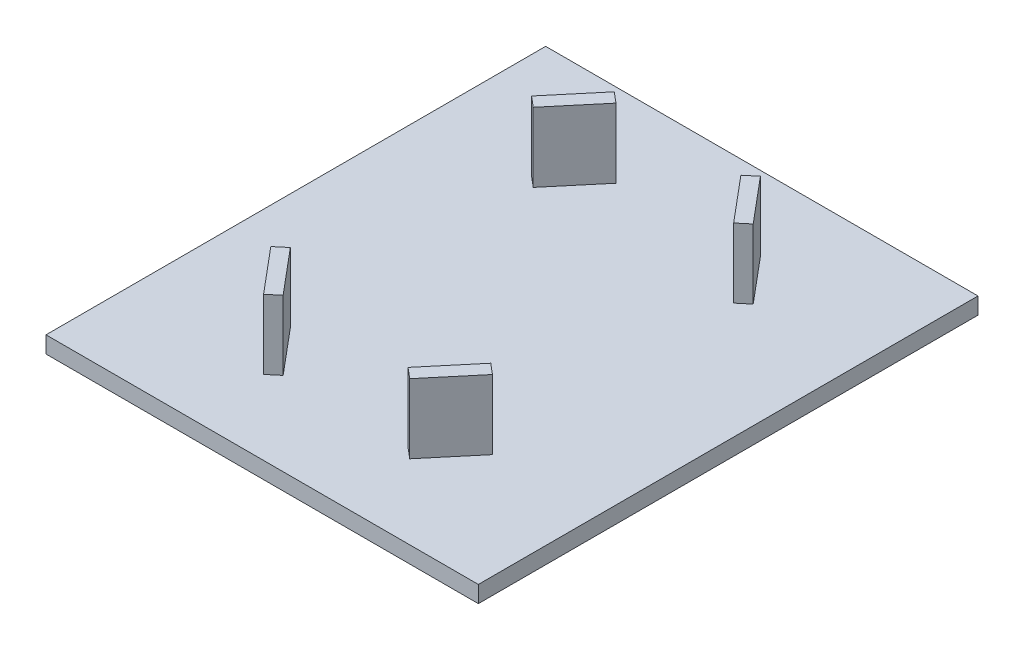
ISO-10303-21;
HEADER;
FILE_DESCRIPTION(('STEP AP214'),'2;1');
FILE_NAME('part.step','',(''),(''),'','','');
FILE_SCHEMA(('AUTOMOTIVE_DESIGN { 1 0 10303 214 1 1 1 1 }'));
ENDSEC;
DATA;
#1=APPLICATION_CONTEXT('core data for automotive mechanical design processes');
#2=APPLICATION_PROTOCOL_DEFINITION('international standard','automotive_design',2000,#1);
#3=PRODUCT_CONTEXT('',#1,'mechanical');
#4=PRODUCT('Part','Part','',(#3));
#5=PRODUCT_RELATED_PRODUCT_CATEGORY('part','',(#4));
#6=PRODUCT_DEFINITION_FORMATION('','',#4);
#7=PRODUCT_DEFINITION_CONTEXT('part definition',#1,'design');
#8=PRODUCT_DEFINITION('design','',#6,#7);
#9=PRODUCT_DEFINITION_SHAPE('','',#8);
#10=(LENGTH_UNIT() NAMED_UNIT(*) SI_UNIT(.MILLI.,.METRE.));
#11=(NAMED_UNIT(*) PLANE_ANGLE_UNIT() SI_UNIT($,.RADIAN.));
#12=(NAMED_UNIT(*) SI_UNIT($,.STERADIAN.) SOLID_ANGLE_UNIT());
#13=UNCERTAINTY_MEASURE_WITH_UNIT(LENGTH_MEASURE(1.E-05),#10,'distance_accuracy_value','');
#14=(GEOMETRIC_REPRESENTATION_CONTEXT(3) GLOBAL_UNCERTAINTY_ASSIGNED_CONTEXT((#13)) GLOBAL_UNIT_ASSIGNED_CONTEXT((#10,
#11,#12)) REPRESENTATION_CONTEXT('',''));
#15=CARTESIAN_POINT('',(0.,0.,0.));
#16=DIRECTION('',(0.,0.,1.));
#17=DIRECTION('',(1.,0.,0.));
#18=AXIS2_PLACEMENT_3D('',#15,#16,#17);
#19=CARTESIAN_POINT('',(-115.75,12.,-180.));
#20=DIRECTION('',(0.,0.,1.));
#21=DIRECTION('',(1.,0.,0.));
#22=AXIS2_PLACEMENT_3D('',#19,#20,#21);
#23=PLANE('',#22);
#24=DIRECTION('',(-1.,0.,0.));
#25=VECTOR('',#24,1.);
#26=CARTESIAN_POINT('',(-115.75,0.,-180.));
#27=LINE('',#26,#25);
#28=CARTESIAN_POINT('',(155.75,0.,-180.));
#29=VERTEX_POINT('',#28);
#30=CARTESIAN_POINT('',(-155.75,0.,-180.));
#31=VERTEX_POINT('',#30);
#32=EDGE_CURVE('E344',#29,#31,#27,.T.);
#33=ORIENTED_EDGE('',*,*,#32,.T.);
#34=DIRECTION('',(0.,-1.,0.));
#35=VECTOR('',#34,1.);
#36=CARTESIAN_POINT('',(-155.75,12.,-180.));
#37=LINE('',#36,#35);
#38=CARTESIAN_POINT('',(-155.75,12.,-180.));
#39=VERTEX_POINT('',#38);
#40=EDGE_CURVE('E53',#39,#31,#37,.T.);
#41=ORIENTED_EDGE('',*,*,#40,.F.);
#42=DIRECTION('',(-1.,0.,0.));
#43=VECTOR('',#42,1.);
#44=CARTESIAN_POINT('',(115.75,12.,-180.));
#45=LINE('',#44,#43);
#46=CARTESIAN_POINT('',(155.75,12.,-180.));
#47=VERTEX_POINT('',#46);
#48=EDGE_CURVE('E360',#47,#39,#45,.T.);
#49=ORIENTED_EDGE('',*,*,#48,.F.);
#50=DIRECTION('',(0.,-1.,0.));
#51=VECTOR('',#50,1.);
#52=CARTESIAN_POINT('',(155.75,12.,-180.));
#53=LINE('',#52,#51);
#54=EDGE_CURVE('E11',#47,#29,#53,.T.);
#55=ORIENTED_EDGE('',*,*,#54,.T.);
#56=EDGE_LOOP('',(#33,#41,#49,#55));
#57=FACE_BOUND('',#56,.T.);
#58=ADVANCED_FACE('F45',(#57),#23,.F.);
#59=CARTESIAN_POINT('',(-155.75,12.,140.));
#60=DIRECTION('',(1.,0.,0.));
#61=DIRECTION('',(0.,0.,-1.));
#62=AXIS2_PLACEMENT_3D('',#59,#60,#61);
#63=PLANE('',#62);
#64=DIRECTION('',(0.,0.,1.));
#65=VECTOR('',#64,1.);
#66=CARTESIAN_POINT('',(-155.75,0.,140.));
#67=LINE('',#66,#65);
#68=CARTESIAN_POINT('',(-155.75,0.,180.));
#69=VERTEX_POINT('',#68);
#70=EDGE_CURVE('E374',#31,#69,#67,.T.);
#71=ORIENTED_EDGE('',*,*,#70,.T.);
#72=DIRECTION('',(0.,-1.,0.));
#73=VECTOR('',#72,1.);
#74=CARTESIAN_POINT('',(-155.75,12.,180.));
#75=LINE('',#74,#73);
#76=CARTESIAN_POINT('',(-155.75,12.,180.));
#77=VERTEX_POINT('',#76);
#78=EDGE_CURVE('E388',#77,#69,#75,.T.);
#79=ORIENTED_EDGE('',*,*,#78,.F.);
#80=DIRECTION('',(0.,0.,1.));
#81=VECTOR('',#80,1.);
#82=CARTESIAN_POINT('',(-155.75,12.,-180.));
#83=LINE('',#82,#81);
#84=EDGE_CURVE('E364',#39,#77,#83,.T.);
#85=ORIENTED_EDGE('',*,*,#84,.F.);
#86=ORIENTED_EDGE('',*,*,#40,.T.);
#87=EDGE_LOOP('',(#71,#79,#85,#86));
#88=FACE_BOUND('',#87,.T.);
#89=ADVANCED_FACE('F396',(#88),#63,.F.);
#90=CARTESIAN_POINT('',(115.75,12.,180.));
#91=DIRECTION('',(0.,0.,-1.));
#92=DIRECTION('',(-1.,0.,0.));
#93=AXIS2_PLACEMENT_3D('',#90,#91,#92);
#94=PLANE('',#93);
#95=DIRECTION('',(1.,0.,0.));
#96=VECTOR('',#95,1.);
#97=CARTESIAN_POINT('',(115.75,0.,180.));
#98=LINE('',#97,#96);
#99=CARTESIAN_POINT('',(155.75,0.,180.));
#100=VERTEX_POINT('',#99);
#101=EDGE_CURVE('E378',#69,#100,#98,.T.);
#102=ORIENTED_EDGE('',*,*,#101,.T.);
#103=DIRECTION('',(0.,-1.,0.));
#104=VECTOR('',#103,1.);
#105=CARTESIAN_POINT('',(155.75,12.,180.));
#106=LINE('',#105,#104);
#107=CARTESIAN_POINT('',(155.75,12.,180.));
#108=VERTEX_POINT('',#107);
#109=EDGE_CURVE('E370',#108,#100,#106,.T.);
#110=ORIENTED_EDGE('',*,*,#109,.F.);
#111=DIRECTION('',(1.,0.,0.));
#112=VECTOR('',#111,1.);
#113=CARTESIAN_POINT('',(-155.75,12.,180.));
#114=LINE('',#113,#112);
#115=EDGE_CURVE('E367',#77,#108,#114,.T.);
#116=ORIENTED_EDGE('',*,*,#115,.F.);
#117=ORIENTED_EDGE('',*,*,#78,.T.);
#118=EDGE_LOOP('',(#102,#110,#116,#117));
#119=FACE_BOUND('',#118,.T.);
#120=ADVANCED_FACE('F408',(#119),#94,.F.);
#121=CARTESIAN_POINT('',(155.75,12.,140.));
#122=DIRECTION('',(-1.,0.,0.));
#123=DIRECTION('',(0.,0.,1.));
#124=AXIS2_PLACEMENT_3D('',#121,#122,#123);
#125=PLANE('',#124);
#126=DIRECTION('',(0.,0.,-1.));
#127=VECTOR('',#126,1.);
#128=CARTESIAN_POINT('',(155.75,0.,140.));
#129=LINE('',#128,#127);
#130=EDGE_CURVE('E361',#100,#29,#129,.T.);
#131=ORIENTED_EDGE('',*,*,#130,.T.);
#132=ORIENTED_EDGE('',*,*,#54,.F.);
#133=DIRECTION('',(0.,0.,-1.));
#134=VECTOR('',#133,1.);
#135=CARTESIAN_POINT('',(155.75,12.,-180.));
#136=LINE('',#135,#134);
#137=EDGE_CURVE('E356',#108,#47,#136,.T.);
#138=ORIENTED_EDGE('',*,*,#137,.F.);
#139=ORIENTED_EDGE('',*,*,#109,.T.);
#140=EDGE_LOOP('',(#131,#132,#138,#139));
#141=FACE_BOUND('',#140,.T.);
#142=ADVANCED_FACE('F403',(#141),#125,.F.);
#143=CARTESIAN_POINT('',(0.,12.,0.));
#144=DIRECTION('',(0.,1.,0.));
#145=DIRECTION('',(0.,0.,1.));
#146=AXIS2_PLACEMENT_3D('',#143,#144,#145);
#147=PLANE('',#146);
#148=DIRECTION('',(0.642787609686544,0.,0.766044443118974));
#149=VECTOR('',#148,1.);
#150=CARTESIAN_POINT('',(-72.1899158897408,12.,87.5));
#151=LINE('',#150,#149);
#152=CARTESIAN_POINT('',(-72.1899158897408,12.,87.5));
#153=VERTEX_POINT('',#152);
#154=CARTESIAN_POINT('',(-45.,12.,119.903679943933));
#155=VERTEX_POINT('',#154);
#156=EDGE_CURVE('E250',#153,#155,#151,.T.);
#157=ORIENTED_EDGE('',*,*,#156,.T.);
#158=DIRECTION('',(0.76604444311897,0.,-0.642787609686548));
#159=VECTOR('',#158,1.);
#160=CARTESIAN_POINT('',(-52.6604444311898,12.,126.331556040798));
#161=LINE('',#160,#159);
#162=CARTESIAN_POINT('',(-52.6604444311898,12.,126.331556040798));
#163=VERTEX_POINT('',#162);
#164=EDGE_CURVE('E295',#163,#155,#161,.T.);
#165=ORIENTED_EDGE('',*,*,#164,.F.);
#166=DIRECTION('',(0.642787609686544,0.,0.766044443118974));
#167=VECTOR('',#166,1.);
#168=CARTESIAN_POINT('',(-79.8503603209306,12.,93.9278760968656));
#169=LINE('',#168,#167);
#170=CARTESIAN_POINT('',(-79.8503603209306,12.,93.9278760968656));
#171=VERTEX_POINT('',#170);
#172=EDGE_CURVE('E291',#171,#163,#169,.T.);
#173=ORIENTED_EDGE('',*,*,#172,.F.);
#174=DIRECTION('',(-0.766044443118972,0.,0.642787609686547));
#175=VECTOR('',#174,1.);
#176=CARTESIAN_POINT('',(-72.1899158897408,12.,87.5));
#177=LINE('',#176,#175);
#178=EDGE_CURVE('E288',#153,#171,#177,.T.);
#179=ORIENTED_EDGE('',*,*,#178,.F.);
#180=EDGE_LOOP('',(#157,#165,#173,#179));
#181=FACE_BOUND('',#180,.T.);
#182=DIRECTION('',(0.766044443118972,0.,0.642787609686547));
#183=VECTOR('',#182,1.);
#184=CARTESIAN_POINT('',(72.1899158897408,12.,87.5));
#185=LINE('',#184,#183);
#186=CARTESIAN_POINT('',(72.1899158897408,12.,87.5));
#187=VERTEX_POINT('',#186);
#188=CARTESIAN_POINT('',(79.8503603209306,12.,93.9278760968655));
#189=VERTEX_POINT('',#188);
#190=EDGE_CURVE('E196',#187,#189,#185,.T.);
#191=ORIENTED_EDGE('',*,*,#190,.T.);
#192=DIRECTION('',(-0.642787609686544,0.,0.766044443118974));
#193=VECTOR('',#192,1.);
#194=CARTESIAN_POINT('',(79.8503603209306,12.,93.9278760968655));
#195=LINE('',#194,#193);
#196=CARTESIAN_POINT('',(52.6604444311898,12.,126.331556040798));
#197=VERTEX_POINT('',#196);
#198=EDGE_CURVE('E257',#189,#197,#195,.T.);
#199=ORIENTED_EDGE('',*,*,#198,.T.);
#200=DIRECTION('',(-0.76604444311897,0.,-0.642787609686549));
#201=VECTOR('',#200,1.);
#202=CARTESIAN_POINT('',(52.6604444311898,12.,126.331556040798));
#203=LINE('',#202,#201);
#204=CARTESIAN_POINT('',(45.,12.,119.903679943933));
#205=VERTEX_POINT('',#204);
#206=EDGE_CURVE('E253',#197,#205,#203,.T.);
#207=ORIENTED_EDGE('',*,*,#206,.T.);
#208=DIRECTION('',(-0.642787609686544,0.,0.766044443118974));
#209=VECTOR('',#208,1.);
#210=CARTESIAN_POINT('',(72.1899158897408,12.,87.5));
#211=LINE('',#210,#209);
#212=EDGE_CURVE('E68',#187,#205,#211,.T.);
#213=ORIENTED_EDGE('',*,*,#212,.F.);
#214=EDGE_LOOP('',(#191,#199,#207,#213));
#215=FACE_BOUND('',#214,.T.);
#216=DIRECTION('',(-0.642787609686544,0.,-0.766044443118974));
#217=VECTOR('',#216,1.);
#218=CARTESIAN_POINT('',(72.1899158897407,12.,-87.5));
#219=LINE('',#218,#217);
#220=CARTESIAN_POINT('',(72.1899158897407,12.,-87.5));
#221=VERTEX_POINT('',#220);
#222=CARTESIAN_POINT('',(45.,12.,-119.903679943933));
#223=VERTEX_POINT('',#222);
#224=EDGE_CURVE('E199',#221,#223,#219,.T.);
#225=ORIENTED_EDGE('',*,*,#224,.T.);
#226=DIRECTION('',(-0.766044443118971,0.,0.642787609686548));
#227=VECTOR('',#226,1.);
#228=CARTESIAN_POINT('',(52.6604444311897,12.,-126.331556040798));
#229=LINE('',#228,#227);
#230=CARTESIAN_POINT('',(52.6604444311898,12.,-126.331556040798));
#231=VERTEX_POINT('',#230);
#232=EDGE_CURVE('E208',#231,#223,#229,.T.);
#233=ORIENTED_EDGE('',*,*,#232,.F.);
#234=DIRECTION('',(-0.642787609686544,0.,-0.766044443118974));
#235=VECTOR('',#234,1.);
#236=CARTESIAN_POINT('',(79.8503603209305,12.,-93.9278760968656));
#237=LINE('',#236,#235);
#238=CARTESIAN_POINT('',(79.8503603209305,12.,-93.9278760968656));
#239=VERTEX_POINT('',#238);
#240=EDGE_CURVE('E214',#239,#231,#237,.T.);
#241=ORIENTED_EDGE('',*,*,#240,.F.);
#242=DIRECTION('',(0.766044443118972,0.,-0.642787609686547));
#243=VECTOR('',#242,1.);
#244=CARTESIAN_POINT('',(72.1899158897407,12.,-87.5));
#245=LINE('',#244,#243);
#246=EDGE_CURVE('E188',#221,#239,#245,.T.);
#247=ORIENTED_EDGE('',*,*,#246,.F.);
#248=EDGE_LOOP('',(#225,#233,#241,#247));
#249=FACE_BOUND('',#248,.T.);
#250=DIRECTION('',(-0.766044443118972,0.,-0.642787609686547));
#251=VECTOR('',#250,1.);
#252=CARTESIAN_POINT('',(-72.1899158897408,12.,-87.5));
#253=LINE('',#252,#251);
#254=CARTESIAN_POINT('',(-72.1899158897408,12.,-87.5));
#255=VERTEX_POINT('',#254);
#256=CARTESIAN_POINT('',(-79.8503603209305,12.,-93.9278760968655));
#257=VERTEX_POINT('',#256);
#258=EDGE_CURVE('E207',#255,#257,#253,.T.);
#259=ORIENTED_EDGE('',*,*,#258,.T.);
#260=DIRECTION('',(0.642787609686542,0.,-0.766044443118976));
#261=VECTOR('',#260,1.);
#262=CARTESIAN_POINT('',(-79.8503603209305,12.,-93.9278760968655));
#263=LINE('',#262,#261);
#264=CARTESIAN_POINT('',(-52.6604444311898,12.,-126.331556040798));
#265=VERTEX_POINT('',#264);
#266=EDGE_CURVE('E331',#257,#265,#263,.T.);
#267=ORIENTED_EDGE('',*,*,#266,.T.);
#268=DIRECTION('',(0.76604444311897,0.,0.642787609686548));
#269=VECTOR('',#268,1.);
#270=CARTESIAN_POINT('',(-52.6604444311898,12.,-126.331556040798));
#271=LINE('',#270,#269);
#272=CARTESIAN_POINT('',(-45.,12.,-119.903679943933));
#273=VERTEX_POINT('',#272);
#274=EDGE_CURVE('E334',#265,#273,#271,.T.);
#275=ORIENTED_EDGE('',*,*,#274,.T.);
#276=DIRECTION('',(0.642787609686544,0.,-0.766044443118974));
#277=VECTOR('',#276,1.);
#278=CARTESIAN_POINT('',(-72.1899158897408,12.,-87.5));
#279=LINE('',#278,#277);
#280=EDGE_CURVE('E317',#255,#273,#279,.T.);
#281=ORIENTED_EDGE('',*,*,#280,.F.);
#282=EDGE_LOOP('',(#259,#267,#275,#281));
#283=FACE_BOUND('',#282,.T.);
#284=ORIENTED_EDGE('',*,*,#137,.T.);
#285=ORIENTED_EDGE('',*,*,#48,.T.);
#286=ORIENTED_EDGE('',*,*,#84,.T.);
#287=ORIENTED_EDGE('',*,*,#115,.T.);
#288=EDGE_LOOP('',(#284,#285,#286,#287));
#289=FACE_BOUND('',#288,.T.);
#290=ADVANCED_FACE('F211',(#181,#215,#249,#283,#289),#147,.T.);
#291=CARTESIAN_POINT('',(0.,0.,0.));
#292=DIRECTION('',(0.,1.,0.));
#293=DIRECTION('',(0.,0.,1.));
#294=AXIS2_PLACEMENT_3D('',#291,#292,#293);
#295=PLANE('',#294);
#296=ORIENTED_EDGE('',*,*,#32,.F.);
#297=ORIENTED_EDGE('',*,*,#130,.F.);
#298=ORIENTED_EDGE('',*,*,#101,.F.);
#299=ORIENTED_EDGE('',*,*,#70,.F.);
#300=EDGE_LOOP('',(#296,#297,#298,#299));
#301=FACE_BOUND('',#300,.T.);
#302=ADVANCED_FACE('F401',(#301),#295,.F.);
#303=CARTESIAN_POINT('',(-72.1899158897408,62.,-87.5));
#304=DIRECTION('',(-0.642787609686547,0.,0.766044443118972));
#305=DIRECTION('',(0.766044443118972,0.,0.642787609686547));
#306=AXIS2_PLACEMENT_3D('',#303,#304,#305);
#307=PLANE('',#306);
#308=ORIENTED_EDGE('',*,*,#258,.F.);
#309=DIRECTION('',(0.,-1.,0.));
#310=VECTOR('',#309,1.);
#311=CARTESIAN_POINT('',(-72.1899158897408,62.,-87.5));
#312=LINE('',#311,#310);
#313=CARTESIAN_POINT('',(-72.1899158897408,62.,-87.5));
#314=VERTEX_POINT('',#313);
#315=EDGE_CURVE('E340',#314,#255,#312,.T.);
#316=ORIENTED_EDGE('',*,*,#315,.F.);
#317=DIRECTION('',(-0.766044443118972,0.,-0.642787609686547));
#318=VECTOR('',#317,1.);
#319=CARTESIAN_POINT('',(-72.1899158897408,62.,-87.5));
#320=LINE('',#319,#318);
#321=CARTESIAN_POINT('',(-79.8503603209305,62.,-93.9278760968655));
#322=VERTEX_POINT('',#321);
#323=EDGE_CURVE('E312',#314,#322,#320,.T.);
#324=ORIENTED_EDGE('',*,*,#323,.T.);
#325=DIRECTION('',(0.,-1.,0.));
#326=VECTOR('',#325,1.);
#327=CARTESIAN_POINT('',(-79.8503603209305,62.,-93.9278760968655));
#328=LINE('',#327,#326);
#329=EDGE_CURVE('E328',#322,#257,#328,.T.);
#330=ORIENTED_EDGE('',*,*,#329,.T.);
#331=EDGE_LOOP('',(#308,#316,#324,#330));
#332=FACE_BOUND('',#331,.T.);
#333=ADVANCED_FACE('F417',(#332),#307,.T.);
#334=CARTESIAN_POINT('',(-72.1899158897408,62.,-87.5));
#335=DIRECTION('',(-0.766044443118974,0.,-0.642787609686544));
#336=DIRECTION('',(-0.642787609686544,0.,0.766044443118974));
#337=AXIS2_PLACEMENT_3D('',#334,#335,#336);
#338=PLANE('',#337);
#339=ORIENTED_EDGE('',*,*,#280,.T.);
#340=DIRECTION('',(0.,-1.,0.));
#341=VECTOR('',#340,1.);
#342=CARTESIAN_POINT('',(-45.,62.,-119.903679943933));
#343=LINE('',#342,#341);
#344=CARTESIAN_POINT('',(-45.,62.,-119.903679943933));
#345=VERTEX_POINT('',#344);
#346=EDGE_CURVE('E345',#345,#273,#343,.T.);
#347=ORIENTED_EDGE('',*,*,#346,.F.);
#348=DIRECTION('',(0.642787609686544,0.,-0.766044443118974));
#349=VECTOR('',#348,1.);
#350=CARTESIAN_POINT('',(-72.1899158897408,62.,-87.5));
#351=LINE('',#350,#349);
#352=EDGE_CURVE('E325',#314,#345,#351,.T.);
#353=ORIENTED_EDGE('',*,*,#352,.F.);
#354=ORIENTED_EDGE('',*,*,#315,.T.);
#355=EDGE_LOOP('',(#339,#347,#353,#354));
#356=FACE_BOUND('',#355,.T.);
#357=ADVANCED_FACE('F455',(#356),#338,.F.);
#358=CARTESIAN_POINT('',(-52.6604444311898,62.,-126.331556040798));
#359=DIRECTION('',(0.642787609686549,0.,-0.76604444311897));
#360=DIRECTION('',(-0.76604444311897,0.,-0.642787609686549));
#361=AXIS2_PLACEMENT_3D('',#358,#359,#360);
#362=PLANE('',#361);
#363=ORIENTED_EDGE('',*,*,#274,.F.);
#364=DIRECTION('',(0.,-1.,0.));
#365=VECTOR('',#364,1.);
#366=CARTESIAN_POINT('',(-52.6604444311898,62.,-126.331556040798));
#367=LINE('',#366,#365);
#368=CARTESIAN_POINT('',(-52.6604444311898,62.,-126.331556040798));
#369=VERTEX_POINT('',#368);
#370=EDGE_CURVE('E349',#369,#265,#367,.T.);
#371=ORIENTED_EDGE('',*,*,#370,.F.);
#372=DIRECTION('',(0.76604444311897,0.,0.642787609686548));
#373=VECTOR('',#372,1.);
#374=CARTESIAN_POINT('',(-52.6604444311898,62.,-126.331556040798));
#375=LINE('',#374,#373);
#376=EDGE_CURVE('E321',#369,#345,#375,.T.);
#377=ORIENTED_EDGE('',*,*,#376,.T.);
#378=ORIENTED_EDGE('',*,*,#346,.T.);
#379=EDGE_LOOP('',(#363,#371,#377,#378));
#380=FACE_BOUND('',#379,.T.);
#381=ADVANCED_FACE('F464',(#380),#362,.T.);
#382=CARTESIAN_POINT('',(-79.8503603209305,62.,-93.9278760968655));
#383=DIRECTION('',(-0.766044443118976,0.,-0.642787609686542));
#384=DIRECTION('',(-0.642787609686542,0.,0.766044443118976));
#385=AXIS2_PLACEMENT_3D('',#382,#383,#384);
#386=PLANE('',#385);
#387=ORIENTED_EDGE('',*,*,#266,.F.);
#388=ORIENTED_EDGE('',*,*,#329,.F.);
#389=DIRECTION('',(0.642787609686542,0.,-0.766044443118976));
#390=VECTOR('',#389,1.);
#391=CARTESIAN_POINT('',(-79.8503603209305,62.,-93.9278760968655));
#392=LINE('',#391,#390);
#393=EDGE_CURVE('E316',#322,#369,#392,.T.);
#394=ORIENTED_EDGE('',*,*,#393,.T.);
#395=ORIENTED_EDGE('',*,*,#370,.T.);
#396=EDGE_LOOP('',(#387,#388,#394,#395));
#397=FACE_BOUND('',#396,.T.);
#398=ADVANCED_FACE('F474',(#397),#386,.T.);
#399=CARTESIAN_POINT('',(0.,62.,0.));
#400=DIRECTION('',(0.,-1.,0.));
#401=DIRECTION('',(0.,0.,-1.));
#402=AXIS2_PLACEMENT_3D('',#399,#400,#401);
#403=PLANE('',#402);
#404=ORIENTED_EDGE('',*,*,#323,.F.);
#405=ORIENTED_EDGE('',*,*,#352,.T.);
#406=ORIENTED_EDGE('',*,*,#376,.F.);
#407=ORIENTED_EDGE('',*,*,#393,.F.);
#408=EDGE_LOOP('',(#404,#405,#406,#407));
#409=FACE_BOUND('',#408,.T.);
#410=ADVANCED_FACE('F484',(#409),#403,.F.);
#411=CARTESIAN_POINT('',(72.1899158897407,62.,-87.5));
#412=DIRECTION('',(-0.766044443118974,0.,0.642787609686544));
#413=DIRECTION('',(0.642787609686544,0.,0.766044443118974));
#414=AXIS2_PLACEMENT_3D('',#411,#412,#413);
#415=PLANE('',#414);
#416=ORIENTED_EDGE('',*,*,#224,.F.);
#417=DIRECTION('',(0.,-1.,0.));
#418=VECTOR('',#417,1.);
#419=CARTESIAN_POINT('',(72.1899158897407,62.,-87.5));
#420=LINE('',#419,#418);
#421=CARTESIAN_POINT('',(72.1899158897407,62.,-87.5));
#422=VERTEX_POINT('',#421);
#423=EDGE_CURVE('E183',#422,#221,#420,.T.);
#424=ORIENTED_EDGE('',*,*,#423,.F.);
#425=DIRECTION('',(-0.642787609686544,0.,-0.766044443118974));
#426=VECTOR('',#425,1.);
#427=CARTESIAN_POINT('',(72.1899158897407,62.,-87.5));
#428=LINE('',#427,#426);
#429=CARTESIAN_POINT('',(45.,62.,-119.903679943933));
#430=VERTEX_POINT('',#429);
#431=EDGE_CURVE('E216',#422,#430,#428,.T.);
#432=ORIENTED_EDGE('',*,*,#431,.T.);
#433=DIRECTION('',(0.,-1.,0.));
#434=VECTOR('',#433,1.);
#435=CARTESIAN_POINT('',(45.,62.,-119.903679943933));
#436=LINE('',#435,#434);
#437=EDGE_CURVE('E202',#430,#223,#436,.T.);
#438=ORIENTED_EDGE('',*,*,#437,.T.);
#439=EDGE_LOOP('',(#416,#424,#432,#438));
#440=FACE_BOUND('',#439,.T.);
#441=ADVANCED_FACE('F200',(#440),#415,.T.);
#442=CARTESIAN_POINT('',(72.1899158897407,62.,-87.5));
#443=DIRECTION('',(-0.642787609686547,0.,-0.766044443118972));
#444=DIRECTION('',(-0.766044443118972,0.,0.642787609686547));
#445=AXIS2_PLACEMENT_3D('',#442,#443,#444);
#446=PLANE('',#445);
#447=ORIENTED_EDGE('',*,*,#246,.T.);
#448=DIRECTION('',(0.,-1.,0.));
#449=VECTOR('',#448,1.);
#450=CARTESIAN_POINT('',(79.8503603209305,62.,-93.9278760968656));
#451=LINE('',#450,#449);
#452=CARTESIAN_POINT('',(79.8503603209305,62.,-93.9278760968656));
#453=VERTEX_POINT('',#452);
#454=EDGE_CURVE('E195',#453,#239,#451,.T.);
#455=ORIENTED_EDGE('',*,*,#454,.F.);
#456=DIRECTION('',(0.766044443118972,0.,-0.642787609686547));
#457=VECTOR('',#456,1.);
#458=CARTESIAN_POINT('',(72.1899158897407,62.,-87.5));
#459=LINE('',#458,#457);
#460=EDGE_CURVE('E190',#422,#453,#459,.T.);
#461=ORIENTED_EDGE('',*,*,#460,.F.);
#462=ORIENTED_EDGE('',*,*,#423,.T.);
#463=EDGE_LOOP('',(#447,#455,#461,#462));
#464=FACE_BOUND('',#463,.T.);
#465=ADVANCED_FACE('F185',(#464),#446,.F.);
#466=CARTESIAN_POINT('',(79.8503603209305,62.,-93.9278760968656));
#467=DIRECTION('',(-0.766044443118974,0.,0.642787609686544));
#468=DIRECTION('',(0.642787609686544,0.,0.766044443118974));
#469=AXIS2_PLACEMENT_3D('',#466,#467,#468);
#470=PLANE('',#469);
#471=ORIENTED_EDGE('',*,*,#240,.T.);
#472=DIRECTION('',(0.,-1.,0.));
#473=VECTOR('',#472,1.);
#474=CARTESIAN_POINT('',(52.6604444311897,62.,-126.331556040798));
#475=LINE('',#474,#473);
#476=CARTESIAN_POINT('',(52.6604444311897,62.,-126.331556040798));
#477=VERTEX_POINT('',#476);
#478=EDGE_CURVE('E663',#477,#231,#475,.T.);
#479=ORIENTED_EDGE('',*,*,#478,.F.);
#480=DIRECTION('',(-0.642787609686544,0.,-0.766044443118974));
#481=VECTOR('',#480,1.);
#482=CARTESIAN_POINT('',(79.8503603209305,62.,-93.9278760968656));
#483=LINE('',#482,#481);
#484=EDGE_CURVE('E229',#453,#477,#483,.T.);
#485=ORIENTED_EDGE('',*,*,#484,.F.);
#486=ORIENTED_EDGE('',*,*,#454,.T.);
#487=EDGE_LOOP('',(#471,#479,#485,#486));
#488=FACE_BOUND('',#487,.T.);
#489=ADVANCED_FACE('F511',(#488),#470,.F.);
#490=CARTESIAN_POINT('',(52.6604444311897,62.,-126.331556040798));
#491=DIRECTION('',(0.642787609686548,0.,0.766044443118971));
#492=DIRECTION('',(0.766044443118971,0.,-0.642787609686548));
#493=AXIS2_PLACEMENT_3D('',#490,#491,#492);
#494=PLANE('',#493);
#495=ORIENTED_EDGE('',*,*,#232,.T.);
#496=ORIENTED_EDGE('',*,*,#437,.F.);
#497=DIRECTION('',(-0.766044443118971,0.,0.642787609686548));
#498=VECTOR('',#497,1.);
#499=CARTESIAN_POINT('',(52.6604444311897,62.,-126.331556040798));
#500=LINE('',#499,#498);
#501=EDGE_CURVE('E221',#477,#430,#500,.T.);
#502=ORIENTED_EDGE('',*,*,#501,.F.);
#503=ORIENTED_EDGE('',*,*,#478,.T.);
#504=EDGE_LOOP('',(#495,#496,#502,#503));
#505=FACE_BOUND('',#504,.T.);
#506=ADVANCED_FACE('F520',(#505),#494,.F.);
#507=CARTESIAN_POINT('',(0.,62.,0.));
#508=DIRECTION('',(0.,1.,0.));
#509=DIRECTION('',(0.,0.,1.));
#510=AXIS2_PLACEMENT_3D('',#507,#508,#509);
#511=PLANE('',#510);
#512=ORIENTED_EDGE('',*,*,#431,.F.);
#513=ORIENTED_EDGE('',*,*,#460,.T.);
#514=ORIENTED_EDGE('',*,*,#484,.T.);
#515=ORIENTED_EDGE('',*,*,#501,.T.);
#516=EDGE_LOOP('',(#512,#513,#514,#515));
#517=FACE_BOUND('',#516,.T.);
#518=ADVANCED_FACE('F530',(#517),#511,.T.);
#519=CARTESIAN_POINT('',(72.1899158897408,62.,87.5));
#520=DIRECTION('',(0.642787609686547,0.,-0.766044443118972));
#521=DIRECTION('',(-0.766044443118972,0.,-0.642787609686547));
#522=AXIS2_PLACEMENT_3D('',#519,#520,#521);
#523=PLANE('',#522);
#524=ORIENTED_EDGE('',*,*,#190,.F.);
#525=DIRECTION('',(0.,-1.,0.));
#526=VECTOR('',#525,1.);
#527=CARTESIAN_POINT('',(72.1899158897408,62.,87.5));
#528=LINE('',#527,#526);
#529=CARTESIAN_POINT('',(72.1899158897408,62.,87.5));
#530=VERTEX_POINT('',#529);
#531=EDGE_CURVE('E247',#530,#187,#528,.T.);
#532=ORIENTED_EDGE('',*,*,#531,.F.);
#533=DIRECTION('',(0.766044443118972,0.,0.642787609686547));
#534=VECTOR('',#533,1.);
#535=CARTESIAN_POINT('',(72.1899158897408,62.,87.5));
#536=LINE('',#535,#534);
#537=CARTESIAN_POINT('',(79.8503603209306,62.,93.9278760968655));
#538=VERTEX_POINT('',#537);
#539=EDGE_CURVE('E254',#530,#538,#536,.T.);
#540=ORIENTED_EDGE('',*,*,#539,.T.);
#541=DIRECTION('',(0.,-1.,0.));
#542=VECTOR('',#541,1.);
#543=CARTESIAN_POINT('',(79.8503603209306,62.,93.9278760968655));
#544=LINE('',#543,#542);
#545=EDGE_CURVE('E234',#538,#189,#544,.T.);
#546=ORIENTED_EDGE('',*,*,#545,.T.);
#547=EDGE_LOOP('',(#524,#532,#540,#546));
#548=FACE_BOUND('',#547,.T.);
#549=ADVANCED_FACE('F540',(#548),#523,.T.);
#550=CARTESIAN_POINT('',(72.1899158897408,62.,87.5));
#551=DIRECTION('',(0.766044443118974,0.,0.642787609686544));
#552=DIRECTION('',(0.642787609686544,0.,-0.766044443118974));
#553=AXIS2_PLACEMENT_3D('',#550,#551,#552);
#554=PLANE('',#553);
#555=ORIENTED_EDGE('',*,*,#212,.T.);
#556=DIRECTION('',(0.,-1.,0.));
#557=VECTOR('',#556,1.);
#558=CARTESIAN_POINT('',(45.,62.,119.903679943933));
#559=LINE('',#558,#557);
#560=CARTESIAN_POINT('',(45.,62.,119.903679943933));
#561=VERTEX_POINT('',#560);
#562=EDGE_CURVE('E243',#561,#205,#559,.T.);
#563=ORIENTED_EDGE('',*,*,#562,.F.);
#564=DIRECTION('',(-0.642787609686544,0.,0.766044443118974));
#565=VECTOR('',#564,1.);
#566=CARTESIAN_POINT('',(72.1899158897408,62.,87.5));
#567=LINE('',#566,#565);
#568=EDGE_CURVE('E238',#530,#561,#567,.T.);
#569=ORIENTED_EDGE('',*,*,#568,.F.);
#570=ORIENTED_EDGE('',*,*,#531,.T.);
#571=EDGE_LOOP('',(#555,#563,#569,#570));
#572=FACE_BOUND('',#571,.T.);
#573=ADVANCED_FACE('F550',(#572),#554,.F.);
#574=CARTESIAN_POINT('',(52.6604444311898,62.,126.331556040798));
#575=DIRECTION('',(-0.642787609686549,0.,0.76604444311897));
#576=DIRECTION('',(0.76604444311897,0.,0.642787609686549));
#577=AXIS2_PLACEMENT_3D('',#574,#575,#576);
#578=PLANE('',#577);
#579=ORIENTED_EDGE('',*,*,#206,.F.);
#580=DIRECTION('',(0.,-1.,0.));
#581=VECTOR('',#580,1.);
#582=CARTESIAN_POINT('',(52.6604444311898,62.,126.331556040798));
#583=LINE('',#582,#581);
#584=CARTESIAN_POINT('',(52.6604444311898,62.,126.331556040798));
#585=VERTEX_POINT('',#584);
#586=EDGE_CURVE('E239',#585,#197,#583,.T.);
#587=ORIENTED_EDGE('',*,*,#586,.F.);
#588=DIRECTION('',(-0.76604444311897,0.,-0.642787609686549));
#589=VECTOR('',#588,1.);
#590=CARTESIAN_POINT('',(52.6604444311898,62.,126.331556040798));
#591=LINE('',#590,#589);
#592=EDGE_CURVE('E264',#585,#561,#591,.T.);
#593=ORIENTED_EDGE('',*,*,#592,.T.);
#594=ORIENTED_EDGE('',*,*,#562,.T.);
#595=EDGE_LOOP('',(#579,#587,#593,#594));
#596=FACE_BOUND('',#595,.T.);
#597=ADVANCED_FACE('F560',(#596),#578,.T.);
#598=CARTESIAN_POINT('',(79.8503603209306,62.,93.9278760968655));
#599=DIRECTION('',(0.766044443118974,0.,0.642787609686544));
#600=DIRECTION('',(0.642787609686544,0.,-0.766044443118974));
#601=AXIS2_PLACEMENT_3D('',#598,#599,#600);
#602=PLANE('',#601);
#603=ORIENTED_EDGE('',*,*,#198,.F.);
#604=ORIENTED_EDGE('',*,*,#545,.F.);
#605=DIRECTION('',(-0.642787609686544,0.,0.766044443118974));
#606=VECTOR('',#605,1.);
#607=CARTESIAN_POINT('',(79.8503603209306,62.,93.9278760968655));
#608=LINE('',#607,#606);
#609=EDGE_CURVE('E268',#538,#585,#608,.T.);
#610=ORIENTED_EDGE('',*,*,#609,.T.);
#611=ORIENTED_EDGE('',*,*,#586,.T.);
#612=EDGE_LOOP('',(#603,#604,#610,#611));
#613=FACE_BOUND('',#612,.T.);
#614=ADVANCED_FACE('F570',(#613),#602,.T.);
#615=CARTESIAN_POINT('',(0.,62.,0.));
#616=DIRECTION('',(0.,-1.,0.));
#617=DIRECTION('',(0.,0.,-1.));
#618=AXIS2_PLACEMENT_3D('',#615,#616,#617);
#619=PLANE('',#618);
#620=ORIENTED_EDGE('',*,*,#539,.F.);
#621=ORIENTED_EDGE('',*,*,#568,.T.);
#622=ORIENTED_EDGE('',*,*,#592,.F.);
#623=ORIENTED_EDGE('',*,*,#609,.F.);
#624=EDGE_LOOP('',(#620,#621,#622,#623));
#625=FACE_BOUND('',#624,.T.);
#626=ADVANCED_FACE('F580',(#625),#619,.F.);
#627=CARTESIAN_POINT('',(-72.1899158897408,62.,87.5));
#628=DIRECTION('',(0.766044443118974,0.,-0.642787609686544));
#629=DIRECTION('',(-0.642787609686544,0.,-0.766044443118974));
#630=AXIS2_PLACEMENT_3D('',#627,#628,#629);
#631=PLANE('',#630);
#632=ORIENTED_EDGE('',*,*,#156,.F.);
#633=DIRECTION('',(0.,-1.,0.));
#634=VECTOR('',#633,1.);
#635=CARTESIAN_POINT('',(-72.1899158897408,62.,87.5));
#636=LINE('',#635,#634);
#637=CARTESIAN_POINT('',(-72.1899158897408,62.,87.5));
#638=VERTEX_POINT('',#637);
#639=EDGE_CURVE('E285',#638,#153,#636,.T.);
#640=ORIENTED_EDGE('',*,*,#639,.F.);
#641=DIRECTION('',(0.642787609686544,0.,0.766044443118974));
#642=VECTOR('',#641,1.);
#643=CARTESIAN_POINT('',(-72.1899158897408,62.,87.5));
#644=LINE('',#643,#642);
#645=CARTESIAN_POINT('',(-45.,62.,119.903679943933));
#646=VERTEX_POINT('',#645);
#647=EDGE_CURVE('E292',#638,#646,#644,.T.);
#648=ORIENTED_EDGE('',*,*,#647,.T.);
#649=DIRECTION('',(0.,-1.,0.));
#650=VECTOR('',#649,1.);
#651=CARTESIAN_POINT('',(-45.,62.,119.903679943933));
#652=LINE('',#651,#650);
#653=EDGE_CURVE('E275',#646,#155,#652,.T.);
#654=ORIENTED_EDGE('',*,*,#653,.T.);
#655=EDGE_LOOP('',(#632,#640,#648,#654));
#656=FACE_BOUND('',#655,.T.);
#657=ADVANCED_FACE('F590',(#656),#631,.T.);
#658=CARTESIAN_POINT('',(-72.1899158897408,62.,87.5));
#659=DIRECTION('',(0.642787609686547,0.,0.766044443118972));
#660=DIRECTION('',(0.766044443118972,0.,-0.642787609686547));
#661=AXIS2_PLACEMENT_3D('',#658,#659,#660);
#662=PLANE('',#661);
#663=ORIENTED_EDGE('',*,*,#178,.T.);
#664=DIRECTION('',(0.,-1.,0.));
#665=VECTOR('',#664,1.);
#666=CARTESIAN_POINT('',(-79.8503603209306,62.,93.9278760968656));
#667=LINE('',#666,#665);
#668=CARTESIAN_POINT('',(-79.8503603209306,62.,93.9278760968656));
#669=VERTEX_POINT('',#668);
#670=EDGE_CURVE('E281',#669,#171,#667,.T.);
#671=ORIENTED_EDGE('',*,*,#670,.F.);
#672=DIRECTION('',(-0.766044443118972,0.,0.642787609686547));
#673=VECTOR('',#672,1.);
#674=CARTESIAN_POINT('',(-72.1899158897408,62.,87.5));
#675=LINE('',#674,#673);
#676=EDGE_CURVE('E278',#638,#669,#675,.T.);
#677=ORIENTED_EDGE('',*,*,#676,.F.);
#678=ORIENTED_EDGE('',*,*,#639,.T.);
#679=EDGE_LOOP('',(#663,#671,#677,#678));
#680=FACE_BOUND('',#679,.T.);
#681=ADVANCED_FACE('F600',(#680),#662,.F.);
#682=CARTESIAN_POINT('',(-79.8503603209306,62.,93.9278760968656));
#683=DIRECTION('',(0.766044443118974,0.,-0.642787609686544));
#684=DIRECTION('',(-0.642787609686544,0.,-0.766044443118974));
#685=AXIS2_PLACEMENT_3D('',#682,#683,#684);
#686=PLANE('',#685);
#687=ORIENTED_EDGE('',*,*,#172,.T.);
#688=DIRECTION('',(0.,-1.,0.));
#689=VECTOR('',#688,1.);
#690=CARTESIAN_POINT('',(-52.6604444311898,62.,126.331556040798));
#691=LINE('',#690,#689);
#692=CARTESIAN_POINT('',(-52.6604444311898,62.,126.331556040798));
#693=VERTEX_POINT('',#692);
#694=EDGE_CURVE('E60',#693,#163,#691,.T.);
#695=ORIENTED_EDGE('',*,*,#694,.F.);
#696=DIRECTION('',(0.642787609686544,0.,0.766044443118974));
#697=VECTOR('',#696,1.);
#698=CARTESIAN_POINT('',(-79.8503603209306,62.,93.9278760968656));
#699=LINE('',#698,#697);
#700=EDGE_CURVE('E303',#669,#693,#699,.T.);
#701=ORIENTED_EDGE('',*,*,#700,.F.);
#702=ORIENTED_EDGE('',*,*,#670,.T.);
#703=EDGE_LOOP('',(#687,#695,#701,#702));
#704=FACE_BOUND('',#703,.T.);
#705=ADVANCED_FACE('F610',(#704),#686,.F.);
#706=CARTESIAN_POINT('',(-52.6604444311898,62.,126.331556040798));
#707=DIRECTION('',(-0.642787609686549,0.,-0.76604444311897));
#708=DIRECTION('',(-0.76604444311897,0.,0.642787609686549));
#709=AXIS2_PLACEMENT_3D('',#706,#707,#708);
#710=PLANE('',#709);
#711=ORIENTED_EDGE('',*,*,#164,.T.);
#712=ORIENTED_EDGE('',*,*,#653,.F.);
#713=DIRECTION('',(0.76604444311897,0.,-0.642787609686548));
#714=VECTOR('',#713,1.);
#715=CARTESIAN_POINT('',(-52.6604444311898,62.,126.331556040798));
#716=LINE('',#715,#714);
#717=EDGE_CURVE('E306',#693,#646,#716,.T.);
#718=ORIENTED_EDGE('',*,*,#717,.F.);
#719=ORIENTED_EDGE('',*,*,#694,.T.);
#720=EDGE_LOOP('',(#711,#712,#718,#719));
#721=FACE_BOUND('',#720,.T.);
#722=ADVANCED_FACE('F620',(#721),#710,.F.);
#723=CARTESIAN_POINT('',(0.,62.,0.));
#724=DIRECTION('',(0.,1.,0.));
#725=DIRECTION('',(0.,0.,1.));
#726=AXIS2_PLACEMENT_3D('',#723,#724,#725);
#727=PLANE('',#726);
#728=ORIENTED_EDGE('',*,*,#647,.F.);
#729=ORIENTED_EDGE('',*,*,#676,.T.);
#730=ORIENTED_EDGE('',*,*,#700,.T.);
#731=ORIENTED_EDGE('',*,*,#717,.T.);
#732=EDGE_LOOP('',(#728,#729,#730,#731));
#733=FACE_BOUND('',#732,.T.);
#734=ADVANCED_FACE('F630',(#733),#727,.T.);
#735=CLOSED_SHELL('',(#58,#89,#120,#142,#290,#302,#333,#357,#381,#398,#410,#441,#465,#489,#506,
#518,#549,#573,#597,#614,#626,#657,#681,#705,#722,#734));
#736=MANIFOLD_SOLID_BREP('B2',#735);
#737=ADVANCED_BREP_SHAPE_REPRESENTATION('',(#18,#736),#14);
#738=SHAPE_DEFINITION_REPRESENTATION(#9,#737);
ENDSEC;
END-ISO-10303-21;
